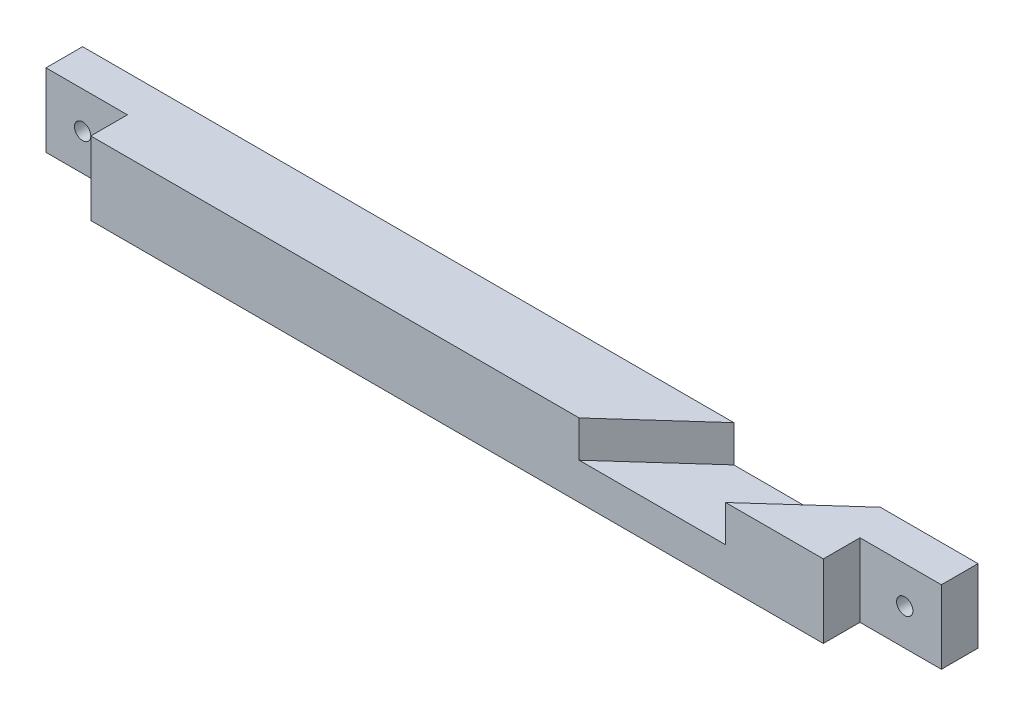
ISO-10303-21;
HEADER;
FILE_DESCRIPTION(('STEP AP214'),'2;1');
FILE_NAME('part.step','',(''),(''),'','','');
FILE_SCHEMA(('AUTOMOTIVE_DESIGN { 1 0 10303 214 1 1 1 1 }'));
ENDSEC;
DATA;
#1=APPLICATION_CONTEXT('core data for automotive mechanical design processes');
#2=APPLICATION_PROTOCOL_DEFINITION('international standard','automotive_design',2000,#1);
#3=PRODUCT_CONTEXT('',#1,'mechanical');
#4=PRODUCT('Part','Part','',(#3));
#5=PRODUCT_RELATED_PRODUCT_CATEGORY('part','',(#4));
#6=PRODUCT_DEFINITION_FORMATION('','',#4);
#7=PRODUCT_DEFINITION_CONTEXT('part definition',#1,'design');
#8=PRODUCT_DEFINITION('design','',#6,#7);
#9=PRODUCT_DEFINITION_SHAPE('','',#8);
#10=(LENGTH_UNIT() NAMED_UNIT(*) SI_UNIT(.MILLI.,.METRE.));
#11=(NAMED_UNIT(*) PLANE_ANGLE_UNIT() SI_UNIT($,.RADIAN.));
#12=(NAMED_UNIT(*) SI_UNIT($,.STERADIAN.) SOLID_ANGLE_UNIT());
#13=UNCERTAINTY_MEASURE_WITH_UNIT(LENGTH_MEASURE(1.E-05),#10,'distance_accuracy_value','');
#14=(GEOMETRIC_REPRESENTATION_CONTEXT(3) GLOBAL_UNCERTAINTY_ASSIGNED_CONTEXT((#13)) GLOBAL_UNIT_ASSIGNED_CONTEXT((#10,
#11,#12)) REPRESENTATION_CONTEXT('',''));
#15=CARTESIAN_POINT('',(0.,0.,0.));
#16=DIRECTION('',(0.,0.,1.));
#17=DIRECTION('',(1.,0.,0.));
#18=AXIS2_PLACEMENT_3D('',#15,#16,#17);
#19=CARTESIAN_POINT('',(-67.2716845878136,-100.617562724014,9.));
#20=DIRECTION('',(0.,-1.,0.));
#21=DIRECTION('',(0.,0.,-1.));
#22=AXIS2_PLACEMENT_3D('',#19,#20,#21);
#23=PLANE('',#22);
#24=DIRECTION('',(-1.,0.,0.));
#25=VECTOR('',#24,1.);
#26=CARTESIAN_POINT('',(-67.2716845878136,-100.617562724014,0.));
#27=LINE('',#26,#25);
#28=CARTESIAN_POINT('',(42.7283154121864,-100.617562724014,0.));
#29=VERTEX_POINT('',#28);
#30=CARTESIAN_POINT('',(30.7283154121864,-100.617562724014,0.));
#31=VERTEX_POINT('',#30);
#32=EDGE_CURVE('E198',#29,#31,#27,.T.);
#33=ORIENTED_EDGE('',*,*,#32,.T.);
#34=DIRECTION('',(0.743294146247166,0.,-0.66896473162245));
#35=VECTOR('',#34,1.);
#36=CARTESIAN_POINT('',(30.7283154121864,-100.617562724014,0.));
#37=LINE('',#36,#35);
#38=CARTESIAN_POINT('',(20.7283154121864,-100.617562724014,9.));
#39=VERTEX_POINT('',#38);
#40=EDGE_CURVE('E133',#39,#31,#37,.T.);
#41=ORIENTED_EDGE('',*,*,#40,.F.);
#42=DIRECTION('',(-1.,0.,0.));
#43=VECTOR('',#42,1.);
#44=CARTESIAN_POINT('',(-67.2716845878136,-100.617562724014,9.));
#45=LINE('',#44,#43);
#46=CARTESIAN_POINT('',(32.7283154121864,-100.617562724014,9.));
#47=VERTEX_POINT('',#46);
#48=EDGE_CURVE('E199',#47,#39,#45,.T.);
#49=ORIENTED_EDGE('',*,*,#48,.F.);
#50=DIRECTION('',(0.,0.,1.));
#51=VECTOR('',#50,1.);
#52=CARTESIAN_POINT('',(32.7283154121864,-100.617562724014,4.5));
#53=LINE('',#52,#51);
#54=CARTESIAN_POINT('',(32.7283154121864,-100.617562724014,4.5));
#55=VERTEX_POINT('',#54);
#56=EDGE_CURVE('E53',#55,#47,#53,.T.);
#57=ORIENTED_EDGE('',*,*,#56,.F.);
#58=DIRECTION('',(-1.,0.,0.));
#59=VECTOR('',#58,1.);
#60=CARTESIAN_POINT('',(42.7283154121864,-100.617562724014,4.5));
#61=LINE('',#60,#59);
#62=CARTESIAN_POINT('',(42.7283154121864,-100.617562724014,4.5));
#63=VERTEX_POINT('',#62);
#64=EDGE_CURVE('E162',#63,#55,#61,.T.);
#65=ORIENTED_EDGE('',*,*,#64,.F.);
#66=DIRECTION('',(0.,0.,-1.));
#67=VECTOR('',#66,1.);
#68=CARTESIAN_POINT('',(42.7283154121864,-100.617562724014,9.));
#69=LINE('',#68,#67);
#70=EDGE_CURVE('E215',#63,#29,#69,.T.);
#71=ORIENTED_EDGE('',*,*,#70,.T.);
#72=EDGE_LOOP('',(#33,#41,#49,#57,#65,#71));
#73=FACE_BOUND('',#72,.T.);
#74=ADVANCED_FACE('F30',(#73),#23,.F.);
#75=CARTESIAN_POINT('',(42.7283154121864,-109.617562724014,9.));
#76=DIRECTION('',(-1.,0.,0.));
#77=DIRECTION('',(0.,0.,1.));
#78=AXIS2_PLACEMENT_3D('',#75,#76,#77);
#79=PLANE('',#78);
#80=DIRECTION('',(0.,1.,0.));
#81=VECTOR('',#80,1.);
#82=CARTESIAN_POINT('',(42.7283154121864,-109.617562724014,4.5));
#83=LINE('',#82,#81);
#84=CARTESIAN_POINT('',(42.7283154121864,-109.617562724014,4.5));
#85=VERTEX_POINT('',#84);
#86=EDGE_CURVE('E160',#85,#63,#83,.T.);
#87=ORIENTED_EDGE('',*,*,#86,.F.);
#88=DIRECTION('',(0.,0.,-1.));
#89=VECTOR('',#88,1.);
#90=CARTESIAN_POINT('',(42.7283154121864,-109.617562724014,9.));
#91=LINE('',#90,#89);
#92=CARTESIAN_POINT('',(42.7283154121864,-109.617562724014,0.));
#93=VERTEX_POINT('',#92);
#94=EDGE_CURVE('E38',#85,#93,#91,.T.);
#95=ORIENTED_EDGE('',*,*,#94,.T.);
#96=DIRECTION('',(0.,1.,0.));
#97=VECTOR('',#96,1.);
#98=CARTESIAN_POINT('',(42.7283154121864,-109.617562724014,0.));
#99=LINE('',#98,#97);
#100=EDGE_CURVE('E208',#93,#29,#99,.T.);
#101=ORIENTED_EDGE('',*,*,#100,.T.);
#102=ORIENTED_EDGE('',*,*,#70,.F.);
#103=EDGE_LOOP('',(#87,#95,#101,#102));
#104=FACE_BOUND('',#103,.T.);
#105=ADVANCED_FACE('F219',(#104),#79,.F.);
#106=CARTESIAN_POINT('',(-67.2716845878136,-109.617562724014,9.));
#107=DIRECTION('',(1.,0.,0.));
#108=DIRECTION('',(0.,0.,-1.));
#109=AXIS2_PLACEMENT_3D('',#106,#107,#108);
#110=PLANE('',#109);
#111=DIRECTION('',(0.,0.,-1.));
#112=VECTOR('',#111,1.);
#113=CARTESIAN_POINT('',(-67.2716845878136,-109.617562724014,9.));
#114=LINE('',#113,#112);
#115=CARTESIAN_POINT('',(-67.2716845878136,-109.617562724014,4.5));
#116=VERTEX_POINT('',#115);
#117=CARTESIAN_POINT('',(-67.2716845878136,-109.617562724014,0.));
#118=VERTEX_POINT('',#117);
#119=EDGE_CURVE('E11',#116,#118,#114,.T.);
#120=ORIENTED_EDGE('',*,*,#119,.F.);
#121=DIRECTION('',(0.,-1.,0.));
#122=VECTOR('',#121,1.);
#123=CARTESIAN_POINT('',(-67.2716845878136,-109.617562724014,4.5));
#124=LINE('',#123,#122);
#125=CARTESIAN_POINT('',(-67.2716845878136,-100.617562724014,4.5));
#126=VERTEX_POINT('',#125);
#127=EDGE_CURVE('E176',#126,#116,#124,.T.);
#128=ORIENTED_EDGE('',*,*,#127,.F.);
#129=DIRECTION('',(0.,0.,-1.));
#130=VECTOR('',#129,1.);
#131=CARTESIAN_POINT('',(-67.2716845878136,-100.617562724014,9.));
#132=LINE('',#131,#130);
#133=CARTESIAN_POINT('',(-67.2716845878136,-100.617562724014,0.));
#134=VERTEX_POINT('',#133);
#135=EDGE_CURVE('E202',#126,#134,#132,.T.);
#136=ORIENTED_EDGE('',*,*,#135,.T.);
#137=DIRECTION('',(0.,-1.,0.));
#138=VECTOR('',#137,1.);
#139=CARTESIAN_POINT('',(-67.2716845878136,-109.617562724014,0.));
#140=LINE('',#139,#138);
#141=EDGE_CURVE('E192',#134,#118,#140,.T.);
#142=ORIENTED_EDGE('',*,*,#141,.T.);
#143=EDGE_LOOP('',(#120,#128,#136,#142));
#144=FACE_BOUND('',#143,.T.);
#145=ADVANCED_FACE('F32',(#144),#110,.F.);
#146=CARTESIAN_POINT('',(-67.2716845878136,-109.617562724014,9.));
#147=DIRECTION('',(0.,1.,0.));
#148=DIRECTION('',(0.,0.,1.));
#149=AXIS2_PLACEMENT_3D('',#146,#147,#148);
#150=PLANE('',#149);
#151=CARTESIAN_POINT('',(17.7283154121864,-109.617562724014,4.5));
#152=DIRECTION('',(0.,1.,0.));
#153=DIRECTION('',(0.,0.,1.));
#154=AXIS2_PLACEMENT_3D('',#151,#152,#153);
#155=CIRCLE('',#154,1.);
#156=CARTESIAN_POINT('',(17.7283154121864,-109.617562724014,5.5));
#157=VERTEX_POINT('',#156);
#158=EDGE_CURVE('E308',#157,#157,#155,.T.);
#159=ORIENTED_EDGE('',*,*,#158,.T.);
#160=EDGE_LOOP('',(#159));
#161=FACE_BOUND('',#160,.T.);
#162=DIRECTION('',(1.,0.,0.));
#163=VECTOR('',#162,1.);
#164=CARTESIAN_POINT('',(42.7283154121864,-109.617562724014,4.5));
#165=LINE('',#164,#163);
#166=CARTESIAN_POINT('',(32.7283154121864,-109.617562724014,4.5));
#167=VERTEX_POINT('',#166);
#168=EDGE_CURVE('E168',#167,#85,#165,.T.);
#169=ORIENTED_EDGE('',*,*,#168,.F.);
#170=DIRECTION('',(0.,0.,1.));
#171=VECTOR('',#170,1.);
#172=CARTESIAN_POINT('',(32.7283154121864,-109.617562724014,4.5));
#173=LINE('',#172,#171);
#174=CARTESIAN_POINT('',(32.7283154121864,-109.617562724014,9.));
#175=VERTEX_POINT('',#174);
#176=EDGE_CURVE('E171',#167,#175,#173,.T.);
#177=ORIENTED_EDGE('',*,*,#176,.T.);
#178=DIRECTION('',(1.,0.,0.));
#179=VECTOR('',#178,1.);
#180=CARTESIAN_POINT('',(-67.2716845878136,-109.617562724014,9.));
#181=LINE('',#180,#179);
#182=CARTESIAN_POINT('',(-57.2716845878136,-109.617562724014,9.));
#183=VERTEX_POINT('',#182);
#184=EDGE_CURVE('E194',#183,#175,#181,.T.);
#185=ORIENTED_EDGE('',*,*,#184,.F.);
#186=DIRECTION('',(0.,0.,1.));
#187=VECTOR('',#186,1.);
#188=CARTESIAN_POINT('',(-57.2716845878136,-109.617562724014,4.5));
#189=LINE('',#188,#187);
#190=CARTESIAN_POINT('',(-57.2716845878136,-109.617562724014,4.5));
#191=VERTEX_POINT('',#190);
#192=EDGE_CURVE('E186',#191,#183,#189,.T.);
#193=ORIENTED_EDGE('',*,*,#192,.F.);
#194=DIRECTION('',(1.,0.,0.));
#195=VECTOR('',#194,1.);
#196=CARTESIAN_POINT('',(-67.2716845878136,-109.617562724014,4.5));
#197=LINE('',#196,#195);
#198=EDGE_CURVE('E178',#116,#191,#197,.T.);
#199=ORIENTED_EDGE('',*,*,#198,.F.);
#200=ORIENTED_EDGE('',*,*,#119,.T.);
#201=DIRECTION('',(1.,0.,0.));
#202=VECTOR('',#201,1.);
#203=CARTESIAN_POINT('',(-67.2716845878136,-109.617562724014,0.));
#204=LINE('',#203,#202);
#205=EDGE_CURVE('E205',#118,#93,#204,.T.);
#206=ORIENTED_EDGE('',*,*,#205,.T.);
#207=ORIENTED_EDGE('',*,*,#94,.F.);
#208=EDGE_LOOP('',(#169,#177,#185,#193,#199,#200,#206,#207));
#209=FACE_BOUND('',#208,.T.);
#210=ADVANCED_FACE('F226',(#161,#209),#150,.F.);
#211=CARTESIAN_POINT('',(2.72831541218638,-100.617562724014,9.));
#212=VERTEX_POINT('',#211);
#213=CARTESIAN_POINT('',(-57.2716845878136,-100.617562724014,9.));
#214=VERTEX_POINT('',#213);
#215=EDGE_CURVE('E197',#212,#214,#45,.T.);
#216=ORIENTED_EDGE('',*,*,#215,.F.);
#217=DIRECTION('',(-0.743294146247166,0.,0.66896473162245));
#218=VECTOR('',#217,1.);
#219=CARTESIAN_POINT('',(2.72831541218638,-100.617562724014,9.));
#220=LINE('',#219,#218);
#221=CARTESIAN_POINT('',(12.7283154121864,-100.617562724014,0.));
#222=VERTEX_POINT('',#221);
#223=EDGE_CURVE('E313',#222,#212,#220,.T.);
#224=ORIENTED_EDGE('',*,*,#223,.F.);
#225=EDGE_CURVE('E139',#222,#134,#27,.T.);
#226=ORIENTED_EDGE('',*,*,#225,.T.);
#227=ORIENTED_EDGE('',*,*,#135,.F.);
#228=DIRECTION('',(-1.,0.,0.));
#229=VECTOR('',#228,1.);
#230=CARTESIAN_POINT('',(-67.2716845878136,-100.617562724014,4.5));
#231=LINE('',#230,#229);
#232=CARTESIAN_POINT('',(-57.2716845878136,-100.617562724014,4.5));
#233=VERTEX_POINT('',#232);
#234=EDGE_CURVE('E184',#233,#126,#231,.T.);
#235=ORIENTED_EDGE('',*,*,#234,.F.);
#236=DIRECTION('',(0.,0.,1.));
#237=VECTOR('',#236,1.);
#238=CARTESIAN_POINT('',(-57.2716845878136,-100.617562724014,4.5));
#239=LINE('',#238,#237);
#240=EDGE_CURVE('E189',#233,#214,#239,.T.);
#241=ORIENTED_EDGE('',*,*,#240,.T.);
#242=EDGE_LOOP('',(#216,#224,#226,#227,#235,#241));
#243=FACE_BOUND('',#242,.T.);
#244=ADVANCED_FACE('F245',(#243),#23,.F.);
#245=CARTESIAN_POINT('',(-67.2716845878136,-100.617562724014,9.));
#246=DIRECTION('',(0.,0.,-1.));
#247=DIRECTION('',(-1.,0.,0.));
#248=AXIS2_PLACEMENT_3D('',#245,#246,#247);
#249=PLANE('',#248);
#250=ORIENTED_EDGE('',*,*,#48,.T.);
#251=DIRECTION('',(0.,1.,0.));
#252=VECTOR('',#251,1.);
#253=CARTESIAN_POINT('',(20.7283154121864,-105.117562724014,9.));
#254=LINE('',#253,#252);
#255=CARTESIAN_POINT('',(20.7283154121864,-105.117562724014,9.));
#256=VERTEX_POINT('',#255);
#257=EDGE_CURVE('E141',#256,#39,#254,.T.);
#258=ORIENTED_EDGE('',*,*,#257,.F.);
#259=DIRECTION('',(1.,0.,0.));
#260=VECTOR('',#259,1.);
#261=CARTESIAN_POINT('',(20.7283154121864,-105.117562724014,9.));
#262=LINE('',#261,#260);
#263=CARTESIAN_POINT('',(2.72831541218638,-105.117562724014,9.));
#264=VERTEX_POINT('',#263);
#265=EDGE_CURVE('E126',#264,#256,#262,.T.);
#266=ORIENTED_EDGE('',*,*,#265,.F.);
#267=DIRECTION('',(0.,1.,0.));
#268=VECTOR('',#267,1.);
#269=CARTESIAN_POINT('',(2.72831541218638,-105.117562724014,9.));
#270=LINE('',#269,#268);
#271=EDGE_CURVE('E124',#264,#212,#270,.T.);
#272=ORIENTED_EDGE('',*,*,#271,.T.);
#273=ORIENTED_EDGE('',*,*,#215,.T.);
#274=DIRECTION('',(0.,1.,0.));
#275=VECTOR('',#274,1.);
#276=CARTESIAN_POINT('',(-57.2716845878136,-109.617562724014,9.));
#277=LINE('',#276,#275);
#278=EDGE_CURVE('E174',#183,#214,#277,.T.);
#279=ORIENTED_EDGE('',*,*,#278,.F.);
#280=ORIENTED_EDGE('',*,*,#184,.T.);
#281=DIRECTION('',(0.,-1.,0.));
#282=VECTOR('',#281,1.);
#283=CARTESIAN_POINT('',(32.7283154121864,-109.617562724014,9.));
#284=LINE('',#283,#282);
#285=EDGE_CURVE('E157',#47,#175,#284,.T.);
#286=ORIENTED_EDGE('',*,*,#285,.F.);
#287=EDGE_LOOP('',(#250,#258,#266,#272,#273,#279,#280,#286));
#288=FACE_BOUND('',#287,.T.);
#289=ADVANCED_FACE('F239',(#288),#249,.F.);
#290=CARTESIAN_POINT('',(-67.2716845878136,-100.617562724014,0.));
#291=DIRECTION('',(0.,0.,-1.));
#292=DIRECTION('',(-1.,0.,0.));
#293=AXIS2_PLACEMENT_3D('',#290,#291,#292);
#294=PLANE('',#293);
#295=DIRECTION('',(0.,1.,0.));
#296=VECTOR('',#295,1.);
#297=CARTESIAN_POINT('',(30.7283154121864,-105.117562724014,0.));
#298=LINE('',#297,#296);
#299=CARTESIAN_POINT('',(30.7283154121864,-105.117562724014,0.));
#300=VERTEX_POINT('',#299);
#301=EDGE_CURVE('E153',#300,#31,#298,.T.);
#302=ORIENTED_EDGE('',*,*,#301,.T.);
#303=ORIENTED_EDGE('',*,*,#32,.F.);
#304=ORIENTED_EDGE('',*,*,#100,.F.);
#305=ORIENTED_EDGE('',*,*,#205,.F.);
#306=ORIENTED_EDGE('',*,*,#141,.F.);
#307=ORIENTED_EDGE('',*,*,#225,.F.);
#308=DIRECTION('',(0.,1.,0.));
#309=VECTOR('',#308,1.);
#310=CARTESIAN_POINT('',(12.7283154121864,-105.117562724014,0.));
#311=LINE('',#310,#309);
#312=CARTESIAN_POINT('',(12.7283154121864,-105.117562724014,0.));
#313=VERTEX_POINT('',#312);
#314=EDGE_CURVE('E121',#313,#222,#311,.T.);
#315=ORIENTED_EDGE('',*,*,#314,.F.);
#316=DIRECTION('',(-1.,0.,0.));
#317=VECTOR('',#316,1.);
#318=CARTESIAN_POINT('',(12.7283154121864,-105.117562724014,0.));
#319=LINE('',#318,#317);
#320=EDGE_CURVE('E127',#300,#313,#319,.T.);
#321=ORIENTED_EDGE('',*,*,#320,.F.);
#322=EDGE_LOOP('',(#302,#303,#304,#305,#306,#307,#315,#321));
#323=FACE_BOUND('',#322,.T.);
#324=CARTESIAN_POINT('',(-62.7716845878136,-105.117562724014,0.));
#325=DIRECTION('',(0.,0.,1.));
#326=DIRECTION('',(1.,0.,0.));
#327=AXIS2_PLACEMENT_3D('',#324,#325,#326);
#328=CIRCLE('',#327,0.999999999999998);
#329=CARTESIAN_POINT('',(-61.7716845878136,-105.117562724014,0.));
#330=VERTEX_POINT('',#329);
#331=EDGE_CURVE('E146',#330,#330,#328,.T.);
#332=ORIENTED_EDGE('',*,*,#331,.T.);
#333=EDGE_LOOP('',(#332));
#334=FACE_BOUND('',#333,.T.);
#335=CARTESIAN_POINT('',(38.2284017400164,-105.145436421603,0.));
#336=DIRECTION('',(0.,0.,1.));
#337=DIRECTION('',(1.,0.,0.));
#338=AXIS2_PLACEMENT_3D('',#335,#336,#337);
#339=CIRCLE('',#338,0.999999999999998);
#340=CARTESIAN_POINT('',(39.2284017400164,-105.145436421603,0.));
#341=VERTEX_POINT('',#340);
#342=EDGE_CURVE('E154',#341,#341,#339,.T.);
#343=ORIENTED_EDGE('',*,*,#342,.T.);
#344=EDGE_LOOP('',(#343));
#345=FACE_BOUND('',#344,.T.);
#346=ADVANCED_FACE('F136',(#323,#334,#345),#294,.T.);
#347=CARTESIAN_POINT('',(-57.2716845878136,-109.617562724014,4.5));
#348=DIRECTION('',(1.,0.,0.));
#349=DIRECTION('',(0.,1.,0.));
#350=AXIS2_PLACEMENT_3D('',#347,#348,#349);
#351=PLANE('',#350);
#352=ORIENTED_EDGE('',*,*,#278,.T.);
#353=ORIENTED_EDGE('',*,*,#240,.F.);
#354=DIRECTION('',(0.,1.,0.));
#355=VECTOR('',#354,1.);
#356=CARTESIAN_POINT('',(-57.2716845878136,-109.617562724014,4.5));
#357=LINE('',#356,#355);
#358=EDGE_CURVE('E181',#191,#233,#357,.T.);
#359=ORIENTED_EDGE('',*,*,#358,.F.);
#360=ORIENTED_EDGE('',*,*,#192,.T.);
#361=EDGE_LOOP('',(#352,#353,#359,#360));
#362=FACE_BOUND('',#361,.T.);
#363=ADVANCED_FACE('F242',(#362),#351,.F.);
#364=CARTESIAN_POINT('',(-67.2716845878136,-100.617562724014,4.5));
#365=DIRECTION('',(0.,0.,-1.));
#366=DIRECTION('',(-1.,0.,0.));
#367=AXIS2_PLACEMENT_3D('',#364,#365,#366);
#368=PLANE('',#367);
#369=CARTESIAN_POINT('',(-62.7716845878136,-105.117562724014,4.5));
#370=DIRECTION('',(0.,0.,1.));
#371=DIRECTION('',(1.,0.,0.));
#372=AXIS2_PLACEMENT_3D('',#369,#370,#371);
#373=CIRCLE('',#372,0.999999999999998);
#374=CARTESIAN_POINT('',(-61.7716845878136,-105.117562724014,4.5));
#375=VERTEX_POINT('',#374);
#376=EDGE_CURVE('E150',#375,#375,#373,.T.);
#377=ORIENTED_EDGE('',*,*,#376,.F.);
#378=EDGE_LOOP('',(#377));
#379=FACE_BOUND('',#378,.T.);
#380=ORIENTED_EDGE('',*,*,#127,.T.);
#381=ORIENTED_EDGE('',*,*,#198,.T.);
#382=ORIENTED_EDGE('',*,*,#358,.T.);
#383=ORIENTED_EDGE('',*,*,#234,.T.);
#384=EDGE_LOOP('',(#380,#381,#382,#383));
#385=FACE_BOUND('',#384,.T.);
#386=ADVANCED_FACE('F249',(#379,#385),#368,.F.);
#387=CARTESIAN_POINT('',(32.7283154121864,-109.617562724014,4.5));
#388=DIRECTION('',(-1.,0.,0.));
#389=DIRECTION('',(0.,0.,1.));
#390=AXIS2_PLACEMENT_3D('',#387,#388,#389);
#391=PLANE('',#390);
#392=ORIENTED_EDGE('',*,*,#285,.T.);
#393=ORIENTED_EDGE('',*,*,#176,.F.);
#394=DIRECTION('',(0.,-1.,0.));
#395=VECTOR('',#394,1.);
#396=CARTESIAN_POINT('',(32.7283154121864,-109.617562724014,4.5));
#397=LINE('',#396,#395);
#398=EDGE_CURVE('E165',#55,#167,#397,.T.);
#399=ORIENTED_EDGE('',*,*,#398,.F.);
#400=ORIENTED_EDGE('',*,*,#56,.T.);
#401=EDGE_LOOP('',(#392,#393,#399,#400));
#402=FACE_BOUND('',#401,.T.);
#403=ADVANCED_FACE('F276',(#402),#391,.F.);
#404=CARTESIAN_POINT('',(42.7283154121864,-100.617562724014,4.5));
#405=DIRECTION('',(0.,0.,1.));
#406=DIRECTION('',(1.,0.,0.));
#407=AXIS2_PLACEMENT_3D('',#404,#405,#406);
#408=PLANE('',#407);
#409=CARTESIAN_POINT('',(38.2284017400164,-105.145436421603,4.5));
#410=DIRECTION('',(0.,0.,1.));
#411=DIRECTION('',(1.,0.,0.));
#412=AXIS2_PLACEMENT_3D('',#409,#410,#411);
#413=CIRCLE('',#412,0.999999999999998);
#414=CARTESIAN_POINT('',(39.2284017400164,-105.145436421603,4.5));
#415=VERTEX_POINT('',#414);
#416=EDGE_CURVE('E149',#415,#415,#413,.T.);
#417=ORIENTED_EDGE('',*,*,#416,.F.);
#418=EDGE_LOOP('',(#417));
#419=FACE_BOUND('',#418,.T.);
#420=ORIENTED_EDGE('',*,*,#86,.T.);
#421=ORIENTED_EDGE('',*,*,#64,.T.);
#422=ORIENTED_EDGE('',*,*,#398,.T.);
#423=ORIENTED_EDGE('',*,*,#168,.T.);
#424=EDGE_LOOP('',(#420,#421,#422,#423));
#425=FACE_BOUND('',#424,.T.);
#426=ADVANCED_FACE('F234',(#419,#425),#408,.T.);
#427=CARTESIAN_POINT('',(38.2284017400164,-105.145436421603,0.));
#428=DIRECTION('',(0.,0.,1.));
#429=DIRECTION('',(1.,0.,0.));
#430=AXIS2_PLACEMENT_3D('',#427,#428,#429);
#431=CYLINDRICAL_SURFACE('',#430,0.999999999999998);
#432=ORIENTED_EDGE('',*,*,#342,.F.);
#433=EDGE_LOOP('',(#432));
#434=FACE_BOUND('',#433,.T.);
#435=ORIENTED_EDGE('',*,*,#416,.T.);
#436=EDGE_LOOP('',(#435));
#437=FACE_BOUND('',#436,.T.);
#438=ADVANCED_FACE('F282',(#434,#437),#431,.F.);
#439=CARTESIAN_POINT('',(-62.7716845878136,-105.117562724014,0.));
#440=DIRECTION('',(0.,0.,1.));
#441=DIRECTION('',(1.,0.,0.));
#442=AXIS2_PLACEMENT_3D('',#439,#440,#441);
#443=CYLINDRICAL_SURFACE('',#442,0.999999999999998);
#444=ORIENTED_EDGE('',*,*,#331,.F.);
#445=EDGE_LOOP('',(#444));
#446=FACE_BOUND('',#445,.T.);
#447=ORIENTED_EDGE('',*,*,#376,.T.);
#448=EDGE_LOOP('',(#447));
#449=FACE_BOUND('',#448,.T.);
#450=ADVANCED_FACE('F286',(#446,#449),#443,.F.);
#451=CARTESIAN_POINT('',(30.7283154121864,-105.117562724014,0.));
#452=DIRECTION('',(0.66896473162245,0.,0.743294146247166));
#453=DIRECTION('',(0.743294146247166,0.,-0.66896473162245));
#454=AXIS2_PLACEMENT_3D('',#451,#452,#453);
#455=PLANE('',#454);
#456=ORIENTED_EDGE('',*,*,#40,.T.);
#457=ORIENTED_EDGE('',*,*,#301,.F.);
#458=DIRECTION('',(0.743294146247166,0.,-0.66896473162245));
#459=VECTOR('',#458,1.);
#460=CARTESIAN_POINT('',(30.7283154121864,-105.117562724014,0.));
#461=LINE('',#460,#459);
#462=EDGE_CURVE('E45',#256,#300,#461,.T.);
#463=ORIENTED_EDGE('',*,*,#462,.F.);
#464=ORIENTED_EDGE('',*,*,#257,.T.);
#465=EDGE_LOOP('',(#456,#457,#463,#464));
#466=FACE_BOUND('',#465,.T.);
#467=ADVANCED_FACE('F290',(#466),#455,.F.);
#468=CARTESIAN_POINT('',(2.72831541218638,-105.117562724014,9.));
#469=DIRECTION('',(-0.66896473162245,0.,-0.743294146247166));
#470=DIRECTION('',(-0.743294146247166,0.,0.66896473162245));
#471=AXIS2_PLACEMENT_3D('',#468,#469,#470);
#472=PLANE('',#471);
#473=ORIENTED_EDGE('',*,*,#223,.T.);
#474=ORIENTED_EDGE('',*,*,#271,.F.);
#475=DIRECTION('',(-0.743294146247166,0.,0.66896473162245));
#476=VECTOR('',#475,1.);
#477=CARTESIAN_POINT('',(2.72831541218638,-105.117562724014,9.));
#478=LINE('',#477,#476);
#479=EDGE_CURVE('E118',#313,#264,#478,.T.);
#480=ORIENTED_EDGE('',*,*,#479,.F.);
#481=ORIENTED_EDGE('',*,*,#314,.T.);
#482=EDGE_LOOP('',(#473,#474,#480,#481));
#483=FACE_BOUND('',#482,.T.);
#484=ADVANCED_FACE('F119',(#483),#472,.F.);
#485=CARTESIAN_POINT('',(30.7283154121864,-105.117562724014,0.));
#486=DIRECTION('',(0.,-1.,0.));
#487=DIRECTION('',(0.,0.,-1.));
#488=AXIS2_PLACEMENT_3D('',#485,#486,#487);
#489=PLANE('',#488);
#490=CARTESIAN_POINT('',(17.7283154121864,-105.117562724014,4.5));
#491=DIRECTION('',(0.,1.,0.));
#492=DIRECTION('',(0.,0.,1.));
#493=AXIS2_PLACEMENT_3D('',#490,#491,#492);
#494=CIRCLE('',#493,1.);
#495=CARTESIAN_POINT('',(17.7283154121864,-105.117562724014,5.5));
#496=VERTEX_POINT('',#495);
#497=EDGE_CURVE('E311',#496,#496,#494,.T.);
#498=ORIENTED_EDGE('',*,*,#497,.F.);
#499=EDGE_LOOP('',(#498));
#500=FACE_BOUND('',#499,.T.);
#501=ORIENTED_EDGE('',*,*,#320,.T.);
#502=ORIENTED_EDGE('',*,*,#479,.T.);
#503=ORIENTED_EDGE('',*,*,#265,.T.);
#504=ORIENTED_EDGE('',*,*,#462,.T.);
#505=EDGE_LOOP('',(#501,#502,#503,#504));
#506=FACE_BOUND('',#505,.T.);
#507=ADVANCED_FACE('F130',(#500,#506),#489,.F.);
#508=CARTESIAN_POINT('',(17.7283154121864,-109.617562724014,4.5));
#509=DIRECTION('',(0.,1.,0.));
#510=DIRECTION('',(0.,0.,1.));
#511=AXIS2_PLACEMENT_3D('',#508,#509,#510);
#512=CYLINDRICAL_SURFACE('',#511,1.);
#513=ORIENTED_EDGE('',*,*,#158,.F.);
#514=EDGE_LOOP('',(#513));
#515=FACE_BOUND('',#514,.T.);
#516=ORIENTED_EDGE('',*,*,#497,.T.);
#517=EDGE_LOOP('',(#516));
#518=FACE_BOUND('',#517,.T.);
#519=ADVANCED_FACE('F299',(#515,#518),#512,.F.);
#520=CLOSED_SHELL('',(#74,#105,#145,#210,#244,#289,#346,#363,#386,#403,#426,#438,#450,#467,#484,
#507,#519));
#521=MANIFOLD_SOLID_BREP('B2',#520);
#522=ADVANCED_BREP_SHAPE_REPRESENTATION('',(#18,#521),#14);
#523=SHAPE_DEFINITION_REPRESENTATION(#9,#522);
ENDSEC;
END-ISO-10303-21;
